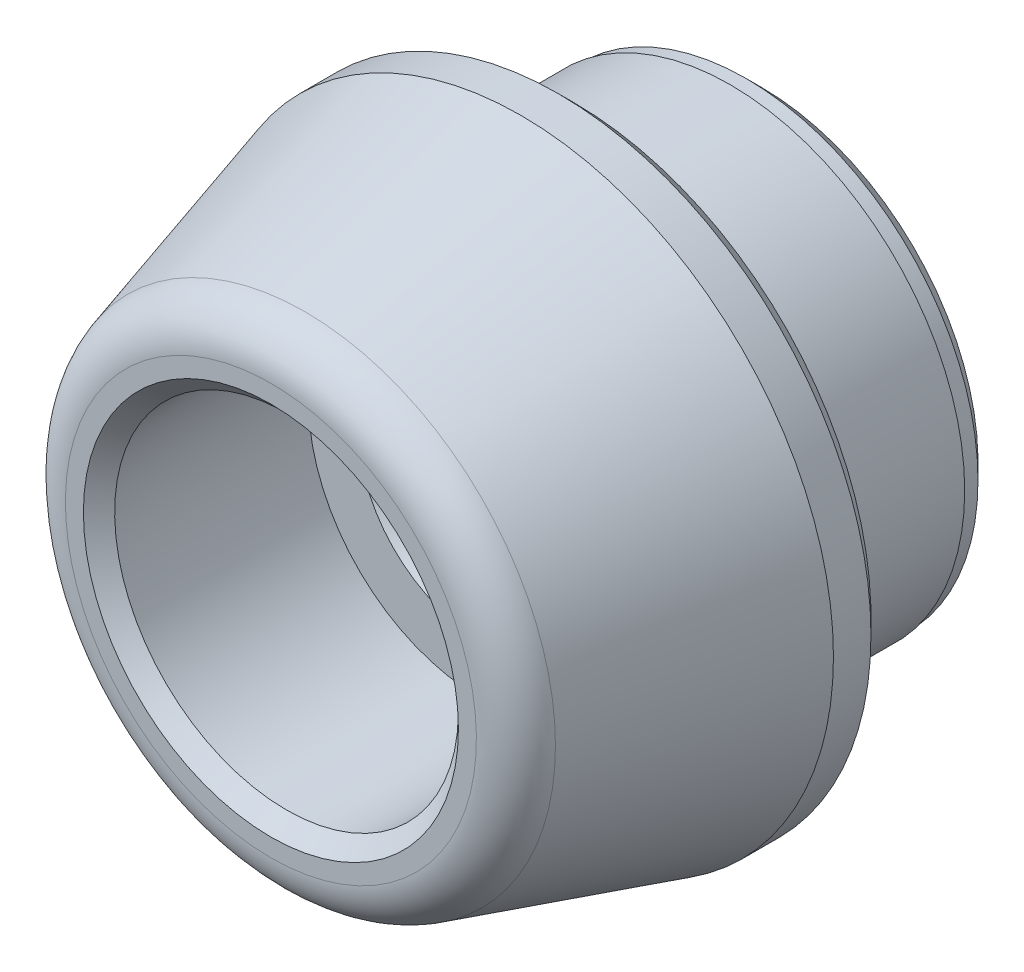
ISO-10303-21;
HEADER;
FILE_DESCRIPTION(('STEP AP214'),'2;1');
FILE_NAME('part.step','',(''),(''),'','','');
FILE_SCHEMA(('AUTOMOTIVE_DESIGN { 1 0 10303 214 1 1 1 1 }'));
ENDSEC;
DATA;
#1=APPLICATION_CONTEXT('core data for automotive mechanical design processes');
#2=APPLICATION_PROTOCOL_DEFINITION('international standard','automotive_design',2000,#1);
#3=PRODUCT_CONTEXT('',#1,'mechanical');
#4=PRODUCT('Part','Part','',(#3));
#5=PRODUCT_RELATED_PRODUCT_CATEGORY('part','',(#4));
#6=PRODUCT_DEFINITION_FORMATION('','',#4);
#7=PRODUCT_DEFINITION_CONTEXT('part definition',#1,'design');
#8=PRODUCT_DEFINITION('design','',#6,#7);
#9=PRODUCT_DEFINITION_SHAPE('','',#8);
#10=(LENGTH_UNIT() NAMED_UNIT(*) SI_UNIT(.MILLI.,.METRE.));
#11=(NAMED_UNIT(*) PLANE_ANGLE_UNIT() SI_UNIT($,.RADIAN.));
#12=(NAMED_UNIT(*) SI_UNIT($,.STERADIAN.) SOLID_ANGLE_UNIT());
#13=UNCERTAINTY_MEASURE_WITH_UNIT(LENGTH_MEASURE(1.E-05),#10,'distance_accuracy_value','');
#14=(GEOMETRIC_REPRESENTATION_CONTEXT(3) GLOBAL_UNCERTAINTY_ASSIGNED_CONTEXT((#13)) GLOBAL_UNIT_ASSIGNED_CONTEXT((#10,
#11,#12)) REPRESENTATION_CONTEXT('',''));
#15=CARTESIAN_POINT('',(0.,0.,0.));
#16=DIRECTION('',(0.,0.,1.));
#17=DIRECTION('',(1.,0.,0.));
#18=AXIS2_PLACEMENT_3D('',#15,#16,#17);
#19=CARTESIAN_POINT('',(0.,0.,0.));
#20=DIRECTION('',(0.,0.,-1.));
#21=DIRECTION('',(0.,1.,0.));
#22=AXIS2_PLACEMENT_3D('',#19,#20,#21);
#23=CYLINDRICAL_SURFACE('',#22,7.5);
#24=CARTESIAN_POINT('',(0.,0.,4.8));
#25=DIRECTION('',(0.,0.,-1.));
#26=DIRECTION('',(0.,1.,0.));
#27=AXIS2_PLACEMENT_3D('',#24,#25,#26);
#28=CIRCLE('',#27,7.5);
#29=CARTESIAN_POINT('',(0.,7.49999999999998,4.80000000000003));
#30=VERTEX_POINT('',#29);
#31=EDGE_CURVE('E76',#30,#30,#28,.T.);
#32=ORIENTED_EDGE('',*,*,#31,.T.);
#33=EDGE_LOOP('',(#32));
#34=FACE_BOUND('',#33,.T.);
#35=CARTESIAN_POINT('',(0.,0.,1.));
#36=DIRECTION('',(0.,0.,-1.));
#37=DIRECTION('',(0.,1.,0.));
#38=AXIS2_PLACEMENT_3D('',#35,#36,#37);
#39=CIRCLE('',#38,7.5);
#40=CARTESIAN_POINT('',(0.,7.5,1.00000000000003));
#41=VERTEX_POINT('',#40);
#42=EDGE_CURVE('E79',#41,#41,#39,.T.);
#43=ORIENTED_EDGE('',*,*,#42,.F.);
#44=EDGE_LOOP('',(#43));
#45=FACE_BOUND('',#44,.T.);
#46=ADVANCED_FACE('F14',(#34,#45),#23,.T.);
#47=CARTESIAN_POINT('',(0.,0.,0.));
#48=DIRECTION('',(0.,0.,-1.));
#49=DIRECTION('',(0.,1.,0.));
#50=AXIS2_PLACEMENT_3D('',#47,#48,#49);
#51=PLANE('',#50);
#52=CARTESIAN_POINT('',(0.,0.,0.));
#53=DIRECTION('',(0.,0.,-1.));
#54=DIRECTION('',(0.,1.,0.));
#55=AXIS2_PLACEMENT_3D('',#52,#53,#54);
#56=CIRCLE('',#55,6.925);
#57=CARTESIAN_POINT('',(0.,6.925,0.));
#58=VERTEX_POINT('',#57);
#59=EDGE_CURVE('E21',#58,#58,#56,.T.);
#60=ORIENTED_EDGE('',*,*,#59,.T.);
#61=EDGE_LOOP('',(#60));
#62=FACE_BOUND('',#61,.T.);
#63=CARTESIAN_POINT('',(0.,0.,0.));
#64=DIRECTION('',(0.,0.,-1.));
#65=DIRECTION('',(0.,1.,0.));
#66=AXIS2_PLACEMENT_3D('',#63,#64,#65);
#67=CIRCLE('',#66,4.4);
#68=CARTESIAN_POINT('',(0.,4.4,0.));
#69=VERTEX_POINT('',#68);
#70=EDGE_CURVE('E29',#69,#69,#67,.F.);
#71=ORIENTED_EDGE('',*,*,#70,.T.);
#72=EDGE_LOOP('',(#71));
#73=FACE_BOUND('',#72,.T.);
#74=ADVANCED_FACE('F105',(#62,#73),#51,.T.);
#75=CARTESIAN_POINT('',(0.,0.,15.7));
#76=DIRECTION('',(0.,0.,1.));
#77=DIRECTION('',(0.,-1.,0.));
#78=AXIS2_PLACEMENT_3D('',#75,#76,#77);
#79=CYLINDRICAL_SURFACE('',#78,3.4);
#80=CARTESIAN_POINT('',(0.,0.,1.));
#81=DIRECTION('',(0.,0.,-1.));
#82=DIRECTION('',(0.,1.,0.));
#83=AXIS2_PLACEMENT_3D('',#80,#81,#82);
#84=CIRCLE('',#83,3.4);
#85=CARTESIAN_POINT('',(0.,3.4,1.00000000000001));
#86=VERTEX_POINT('',#85);
#87=EDGE_CURVE('E25',#86,#86,#84,.T.);
#88=ORIENTED_EDGE('',*,*,#87,.T.);
#89=EDGE_LOOP('',(#88));
#90=FACE_BOUND('',#89,.T.);
#91=CARTESIAN_POINT('',(0.,0.,8.5));
#92=DIRECTION('',(0.,0.,1.));
#93=DIRECTION('',(0.,-1.,0.));
#94=AXIS2_PLACEMENT_3D('',#91,#92,#93);
#95=CIRCLE('',#94,3.4);
#96=CARTESIAN_POINT('',(0.,-3.40000000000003,8.49999999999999));
#97=VERTEX_POINT('',#96);
#98=EDGE_CURVE('E40',#97,#97,#95,.T.);
#99=ORIENTED_EDGE('',*,*,#98,.T.);
#100=EDGE_LOOP('',(#99));
#101=FACE_BOUND('',#100,.T.);
#102=ADVANCED_FACE('F112',(#90,#101),#79,.F.);
#103=CARTESIAN_POINT('',(0.,0.,15.7));
#104=DIRECTION('',(0.,0.,1.));
#105=DIRECTION('',(0.,-1.,0.));
#106=AXIS2_PLACEMENT_3D('',#103,#104,#105);
#107=PLANE('',#106);
#108=CARTESIAN_POINT('',(0.,0.,15.7));
#109=DIRECTION('',(0.,0.,1.));
#110=DIRECTION('',(0.,-1.,0.));
#111=AXIS2_PLACEMENT_3D('',#108,#109,#110);
#112=CIRCLE('',#111,6.);
#113=CARTESIAN_POINT('',(0.,-6.00000000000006,15.7));
#114=VERTEX_POINT('',#113);
#115=EDGE_CURVE('E34',#114,#114,#112,.F.);
#116=ORIENTED_EDGE('',*,*,#115,.T.);
#117=EDGE_LOOP('',(#116));
#118=FACE_BOUND('',#117,.T.);
#119=CARTESIAN_POINT('',(0.,0.,15.7));
#120=DIRECTION('',(0.,0.,1.));
#121=DIRECTION('',(0.,-1.,0.));
#122=AXIS2_PLACEMENT_3D('',#119,#120,#121);
#123=CIRCLE('',#122,6.57570583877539);
#124=CARTESIAN_POINT('',(0.,-6.57570583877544,15.7));
#125=VERTEX_POINT('',#124);
#126=EDGE_CURVE('E52',#125,#125,#123,.T.);
#127=ORIENTED_EDGE('',*,*,#126,.T.);
#128=EDGE_LOOP('',(#127));
#129=FACE_BOUND('',#128,.T.);
#130=ADVANCED_FACE('F129',(#118,#129),#107,.T.);
#131=CARTESIAN_POINT('',(0.,0.,7.7));
#132=DIRECTION('',(0.,0.,-1.));
#133=DIRECTION('',(0.,1.,0.));
#134=AXIS2_PLACEMENT_3D('',#131,#132,#133);
#135=CONICAL_SURFACE('',#134,10.,0.279252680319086);
#136=CARTESIAN_POINT('',(0.,0.,14.6134560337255));
#137=DIRECTION('',(0.,0.,1.));
#138=DIRECTION('',(0.,-1.,0.));
#139=AXIS2_PLACEMENT_3D('',#136,#137,#138);
#140=CIRCLE('',#139,8.01759838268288);
#141=CARTESIAN_POINT('',(0.,-8.01759838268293,14.6134560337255));
#142=VERTEX_POINT('',#141);
#143=EDGE_CURVE('E55',#142,#142,#140,.F.);
#144=ORIENTED_EDGE('',*,*,#143,.T.);
#145=EDGE_LOOP('',(#144));
#146=FACE_BOUND('',#145,.T.);
#147=CARTESIAN_POINT('',(0.,0.,7.7));
#148=DIRECTION('',(0.,0.,-1.));
#149=DIRECTION('',(0.,1.,0.));
#150=AXIS2_PLACEMENT_3D('',#147,#148,#149);
#151=CIRCLE('',#150,10.);
#152=CARTESIAN_POINT('',(0.,9.99999999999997,7.70000000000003));
#153=VERTEX_POINT('',#152);
#154=EDGE_CURVE('E58',#153,#153,#151,.T.);
#155=ORIENTED_EDGE('',*,*,#154,.F.);
#156=EDGE_LOOP('',(#155));
#157=FACE_BOUND('',#156,.T.);
#158=ADVANCED_FACE('F125',(#146,#157),#135,.T.);
#159=CARTESIAN_POINT('',(0.,0.,0.));
#160=DIRECTION('',(0.,0.,-1.));
#161=DIRECTION('',(0.,1.,0.));
#162=AXIS2_PLACEMENT_3D('',#159,#160,#161);
#163=CYLINDRICAL_SURFACE('',#162,10.);
#164=CARTESIAN_POINT('',(0.,0.,6.5));
#165=DIRECTION('',(0.,0.,-1.));
#166=DIRECTION('',(0.,1.,0.));
#167=AXIS2_PLACEMENT_3D('',#164,#165,#166);
#168=CIRCLE('',#167,10.);
#169=CARTESIAN_POINT('',(0.,9.99999999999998,6.50000000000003));
#170=VERTEX_POINT('',#169);
#171=EDGE_CURVE('E46',#170,#170,#168,.F.);
#172=ORIENTED_EDGE('',*,*,#171,.T.);
#173=EDGE_LOOP('',(#172));
#174=FACE_BOUND('',#173,.T.);
#175=ORIENTED_EDGE('',*,*,#154,.T.);
#176=EDGE_LOOP('',(#175));
#177=FACE_BOUND('',#176,.T.);
#178=ADVANCED_FACE('F121',(#174,#177),#163,.T.);
#179=CARTESIAN_POINT('',(10.,0.,6.));
#180=DIRECTION('',(0.,0.,-1.));
#181=DIRECTION('',(0.,1.,0.));
#182=AXIS2_PLACEMENT_3D('',#179,#180,#181);
#183=PLANE('',#182);
#184=CARTESIAN_POINT('',(0.,0.,6.));
#185=DIRECTION('',(0.,0.,-1.));
#186=DIRECTION('',(0.,1.,0.));
#187=AXIS2_PLACEMENT_3D('',#184,#185,#186);
#188=CIRCLE('',#187,9.5);
#189=CARTESIAN_POINT('',(0.,9.49999999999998,6.00000000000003));
#190=VERTEX_POINT('',#189);
#191=EDGE_CURVE('E49',#190,#190,#188,.T.);
#192=ORIENTED_EDGE('',*,*,#191,.T.);
#193=EDGE_LOOP('',(#192));
#194=FACE_BOUND('',#193,.T.);
#195=CARTESIAN_POINT('',(0.,0.,6.));
#196=DIRECTION('',(0.,0.,-1.));
#197=DIRECTION('',(0.,1.,0.));
#198=AXIS2_PLACEMENT_3D('',#195,#196,#197);
#199=CIRCLE('',#198,8.3);
#200=CARTESIAN_POINT('',(0.,8.29999999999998,6.00000000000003));
#201=VERTEX_POINT('',#200);
#202=EDGE_CURVE('E73',#201,#201,#199,.T.);
#203=ORIENTED_EDGE('',*,*,#202,.F.);
#204=EDGE_LOOP('',(#203));
#205=FACE_BOUND('',#204,.T.);
#206=ADVANCED_FACE('F117',(#194,#205),#183,.T.);
#207=CARTESIAN_POINT('',(0.,0.,9.));
#208=DIRECTION('',(0.,0.,1.));
#209=DIRECTION('',(0.,-1.,0.));
#210=AXIS2_PLACEMENT_3D('',#207,#208,#209);
#211=PLANE('',#210);
#212=CARTESIAN_POINT('',(0.,0.,9.));
#213=DIRECTION('',(0.,0.,1.));
#214=DIRECTION('',(0.,-1.,0.));
#215=AXIS2_PLACEMENT_3D('',#212,#213,#214);
#216=CIRCLE('',#215,3.9);
#217=CARTESIAN_POINT('',(0.,-3.90000000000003,8.99999999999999));
#218=VERTEX_POINT('',#217);
#219=EDGE_CURVE('E43',#218,#218,#216,.F.);
#220=ORIENTED_EDGE('',*,*,#219,.T.);
#221=EDGE_LOOP('',(#220));
#222=FACE_BOUND('',#221,.T.);
#223=CARTESIAN_POINT('',(0.,0.,9.));
#224=DIRECTION('',(0.,0.,1.));
#225=DIRECTION('',(0.,-1.,0.));
#226=AXIS2_PLACEMENT_3D('',#223,#224,#225);
#227=CIRCLE('',#226,5.5);
#228=CARTESIAN_POINT('',(0.,-5.50000000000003,8.99999999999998));
#229=VERTEX_POINT('',#228);
#230=EDGE_CURVE('E61',#229,#229,#227,.T.);
#231=ORIENTED_EDGE('',*,*,#230,.T.);
#232=EDGE_LOOP('',(#231));
#233=FACE_BOUND('',#232,.T.);
#234=ADVANCED_FACE('F120',(#222,#233),#211,.T.);
#235=CARTESIAN_POINT('',(0.,0.,9.));
#236=DIRECTION('',(0.,0.,1.));
#237=DIRECTION('',(0.,-1.,0.));
#238=AXIS2_PLACEMENT_3D('',#235,#236,#237);
#239=CYLINDRICAL_SURFACE('',#238,5.5);
#240=CARTESIAN_POINT('',(0.,0.,15.2));
#241=DIRECTION('',(0.,0.,1.));
#242=DIRECTION('',(0.,-1.,0.));
#243=AXIS2_PLACEMENT_3D('',#240,#241,#242);
#244=CIRCLE('',#243,5.5);
#245=CARTESIAN_POINT('',(0.,-5.50000000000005,15.2));
#246=VERTEX_POINT('',#245);
#247=EDGE_CURVE('E37',#246,#246,#244,.T.);
#248=ORIENTED_EDGE('',*,*,#247,.T.);
#249=EDGE_LOOP('',(#248));
#250=FACE_BOUND('',#249,.T.);
#251=ORIENTED_EDGE('',*,*,#230,.F.);
#252=EDGE_LOOP('',(#251));
#253=FACE_BOUND('',#252,.T.);
#254=ADVANCED_FACE('F138',(#250,#253),#239,.F.);
#255=CARTESIAN_POINT('',(0.,0.,14.2));
#256=DIRECTION('',(0.,0.,1.));
#257=DIRECTION('',(0.,-1.,0.));
#258=AXIS2_PLACEMENT_3D('',#255,#256,#257);
#259=TOROIDAL_SURFACE('',#258,6.57570583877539,1.5);
#260=ORIENTED_EDGE('',*,*,#126,.F.);
#261=EDGE_LOOP('',(#260));
#262=FACE_BOUND('',#261,.T.);
#263=ORIENTED_EDGE('',*,*,#143,.F.);
#264=EDGE_LOOP('',(#263));
#265=FACE_BOUND('',#264,.T.);
#266=ADVANCED_FACE('F134',(#262,#265),#259,.T.);
#267=CARTESIAN_POINT('',(0.,0.,5.66602540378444));
#268=DIRECTION('',(0.,0.,-1.));
#269=DIRECTION('',(0.,1.,0.));
#270=AXIS2_PLACEMENT_3D('',#267,#268,#269);
#271=CONICAL_SURFACE('',#270,7.,0.523598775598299);
#272=ORIENTED_EDGE('',*,*,#31,.F.);
#273=EDGE_LOOP('',(#272));
#274=FACE_BOUND('',#273,.T.);
#275=CARTESIAN_POINT('',(0.,0.,5.66602540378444));
#276=DIRECTION('',(0.,0.,-1.));
#277=DIRECTION('',(0.,1.,0.));
#278=AXIS2_PLACEMENT_3D('',#275,#276,#277);
#279=CIRCLE('',#278,7.);
#280=CARTESIAN_POINT('',(0.,6.99999999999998,5.66602540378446));
#281=VERTEX_POINT('',#280);
#282=EDGE_CURVE('E64',#281,#281,#279,.T.);
#283=ORIENTED_EDGE('',*,*,#282,.T.);
#284=EDGE_LOOP('',(#283));
#285=FACE_BOUND('',#284,.T.);
#286=ADVANCED_FACE('F137',(#274,#285),#271,.T.);
#287=CARTESIAN_POINT('',(0.,0.,0.));
#288=DIRECTION('',(0.,0.,-1.));
#289=DIRECTION('',(0.,1.,0.));
#290=AXIS2_PLACEMENT_3D('',#287,#288,#289);
#291=CYLINDRICAL_SURFACE('',#290,7.);
#292=ORIENTED_EDGE('',*,*,#282,.F.);
#293=EDGE_LOOP('',(#292));
#294=FACE_BOUND('',#293,.T.);
#295=CARTESIAN_POINT('',(0.,0.,6.1));
#296=DIRECTION('',(0.,0.,-1.));
#297=DIRECTION('',(0.,1.,0.));
#298=AXIS2_PLACEMENT_3D('',#295,#296,#297);
#299=CIRCLE('',#298,7.);
#300=CARTESIAN_POINT('',(0.,6.99999999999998,6.10000000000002));
#301=VERTEX_POINT('',#300);
#302=EDGE_CURVE('E67',#301,#301,#299,.T.);
#303=ORIENTED_EDGE('',*,*,#302,.T.);
#304=EDGE_LOOP('',(#303));
#305=FACE_BOUND('',#304,.T.);
#306=ADVANCED_FACE('F183',(#294,#305),#291,.T.);
#307=CARTESIAN_POINT('',(0.,0.,6.1));
#308=DIRECTION('',(0.,0.,-1.));
#309=DIRECTION('',(0.,1.,0.));
#310=AXIS2_PLACEMENT_3D('',#307,#308,#309);
#311=TOROIDAL_SURFACE('',#310,7.4,0.4);
#312=ORIENTED_EDGE('',*,*,#302,.F.);
#313=EDGE_LOOP('',(#312));
#314=FACE_BOUND('',#313,.T.);
#315=CARTESIAN_POINT('',(0.,0.,6.43715290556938));
#316=DIRECTION('',(0.,0.,-1.));
#317=DIRECTION('',(0.,1.,0.));
#318=AXIS2_PLACEMENT_3D('',#315,#316,#317);
#319=CIRCLE('',#318,7.61523921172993);
#320=CARTESIAN_POINT('',(0.,7.61523921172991,6.43715290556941));
#321=VERTEX_POINT('',#320);
#322=EDGE_CURVE('E70',#321,#321,#319,.T.);
#323=ORIENTED_EDGE('',*,*,#322,.T.);
#324=EDGE_LOOP('',(#323));
#325=FACE_BOUND('',#324,.T.);
#326=ADVANCED_FACE('F101',(#314,#325),#311,.F.);
#327=CARTESIAN_POINT('',(0.,0.,6.));
#328=DIRECTION('',(0.,0.,-1.));
#329=DIRECTION('',(0.,1.,0.));
#330=AXIS2_PLACEMENT_3D('',#327,#328,#329);
#331=CONICAL_SURFACE('',#330,8.3,1.00261735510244);
#332=ORIENTED_EDGE('',*,*,#322,.F.);
#333=EDGE_LOOP('',(#332));
#334=FACE_BOUND('',#333,.T.);
#335=ORIENTED_EDGE('',*,*,#202,.T.);
#336=EDGE_LOOP('',(#335));
#337=FACE_BOUND('',#336,.T.);
#338=ADVANCED_FACE('F90',(#334,#337),#331,.F.);
#339=CARTESIAN_POINT('',(-7.5,0.,1.));
#340=DIRECTION('',(0.,0.,-1.));
#341=DIRECTION('',(0.,1.,0.));
#342=AXIS2_PLACEMENT_3D('',#339,#340,#341);
#343=PLANE('',#342);
#344=ORIENTED_EDGE('',*,*,#42,.T.);
#345=EDGE_LOOP('',(#344));
#346=FACE_BOUND('',#345,.T.);
#347=CARTESIAN_POINT('',(0.,0.,1.));
#348=DIRECTION('',(0.,0.,-1.));
#349=DIRECTION('',(0.,1.,0.));
#350=AXIS2_PLACEMENT_3D('',#347,#348,#349);
#351=CIRCLE('',#350,7.425);
#352=CARTESIAN_POINT('',(0.,7.425,1.00000000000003));
#353=VERTEX_POINT('',#352);
#354=EDGE_CURVE('E82',#353,#353,#351,.T.);
#355=ORIENTED_EDGE('',*,*,#354,.F.);
#356=EDGE_LOOP('',(#355));
#357=FACE_BOUND('',#356,.T.);
#358=ADVANCED_FACE('F88',(#346,#357),#343,.T.);
#359=CARTESIAN_POINT('',(0.,0.,0.));
#360=DIRECTION('',(0.,0.,-1.));
#361=DIRECTION('',(0.,1.,0.));
#362=AXIS2_PLACEMENT_3D('',#359,#360,#361);
#363=CYLINDRICAL_SURFACE('',#362,7.425);
#364=CARTESIAN_POINT('',(0.,0.,0.5));
#365=DIRECTION('',(0.,0.,-1.));
#366=DIRECTION('',(0.,1.,0.));
#367=AXIS2_PLACEMENT_3D('',#364,#365,#366);
#368=CIRCLE('',#367,7.425);
#369=CARTESIAN_POINT('',(0.,7.425,0.500000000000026));
#370=VERTEX_POINT('',#369);
#371=EDGE_CURVE('E9',#370,#370,#368,.F.);
#372=ORIENTED_EDGE('',*,*,#371,.T.);
#373=EDGE_LOOP('',(#372));
#374=FACE_BOUND('',#373,.T.);
#375=ORIENTED_EDGE('',*,*,#354,.T.);
#376=EDGE_LOOP('',(#375));
#377=FACE_BOUND('',#376,.T.);
#378=ADVANCED_FACE('F86',(#374,#377),#363,.T.);
#379=CARTESIAN_POINT('',(0.,0.,6.));
#380=DIRECTION('',(0.,0.,1.));
#381=DIRECTION('',(0.,-1.,0.));
#382=AXIS2_PLACEMENT_3D('',#379,#380,#381);
#383=CONICAL_SURFACE('',#382,9.5,0.785398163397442);
#384=ORIENTED_EDGE('',*,*,#171,.F.);
#385=EDGE_LOOP('',(#384));
#386=FACE_BOUND('',#385,.T.);
#387=ORIENTED_EDGE('',*,*,#191,.F.);
#388=EDGE_LOOP('',(#387));
#389=FACE_BOUND('',#388,.T.);
#390=ADVANCED_FACE('F99',(#386,#389),#383,.T.);
#391=CARTESIAN_POINT('',(0.,0.,9.));
#392=DIRECTION('',(0.,0.,1.));
#393=DIRECTION('',(0.,-1.,0.));
#394=AXIS2_PLACEMENT_3D('',#391,#392,#393);
#395=CONICAL_SURFACE('',#394,3.9,0.785398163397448);
#396=ORIENTED_EDGE('',*,*,#98,.F.);
#397=EDGE_LOOP('',(#396));
#398=FACE_BOUND('',#397,.T.);
#399=ORIENTED_EDGE('',*,*,#219,.F.);
#400=EDGE_LOOP('',(#399));
#401=FACE_BOUND('',#400,.T.);
#402=ADVANCED_FACE('F142',(#398,#401),#395,.F.);
#403=CARTESIAN_POINT('',(0.,0.,15.2));
#404=DIRECTION('',(0.,0.,1.));
#405=DIRECTION('',(0.,-1.,0.));
#406=AXIS2_PLACEMENT_3D('',#403,#404,#405);
#407=CONICAL_SURFACE('',#406,5.5,0.785398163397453);
#408=ORIENTED_EDGE('',*,*,#115,.F.);
#409=EDGE_LOOP('',(#408));
#410=FACE_BOUND('',#409,.T.);
#411=ORIENTED_EDGE('',*,*,#247,.F.);
#412=EDGE_LOOP('',(#411));
#413=FACE_BOUND('',#412,.T.);
#414=ADVANCED_FACE('F146',(#410,#413),#407,.F.);
#415=CARTESIAN_POINT('',(0.,0.,0.));
#416=DIRECTION('',(0.,0.,-1.));
#417=DIRECTION('',(0.,1.,0.));
#418=AXIS2_PLACEMENT_3D('',#415,#416,#417);
#419=CONICAL_SURFACE('',#418,4.4,0.78539816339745);
#420=ORIENTED_EDGE('',*,*,#87,.F.);
#421=EDGE_LOOP('',(#420));
#422=FACE_BOUND('',#421,.T.);
#423=ORIENTED_EDGE('',*,*,#70,.F.);
#424=EDGE_LOOP('',(#423));
#425=FACE_BOUND('',#424,.T.);
#426=ADVANCED_FACE('F149',(#422,#425),#419,.F.);
#427=CARTESIAN_POINT('',(0.,0.,0.));
#428=DIRECTION('',(0.,0.,1.));
#429=DIRECTION('',(0.,-1.,0.));
#430=AXIS2_PLACEMENT_3D('',#427,#428,#429);
#431=CONICAL_SURFACE('',#430,6.925,0.785398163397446);
#432=ORIENTED_EDGE('',*,*,#371,.F.);
#433=EDGE_LOOP('',(#432));
#434=FACE_BOUND('',#433,.T.);
#435=ORIENTED_EDGE('',*,*,#59,.F.);
#436=EDGE_LOOP('',(#435));
#437=FACE_BOUND('',#436,.T.);
#438=ADVANCED_FACE('F16',(#434,#437),#431,.T.);
#439=CLOSED_SHELL('',(#46,#74,#102,#130,#158,#178,#206,#234,#254,#266,#286,#306,#326,#338,#358,
#378,#390,#402,#414,#426,#438));
#440=MANIFOLD_SOLID_BREP('B1',#439);
#441=ADVANCED_BREP_SHAPE_REPRESENTATION('',(#18,#440),#14);
#442=SHAPE_DEFINITION_REPRESENTATION(#9,#441);
ENDSEC;
END-ISO-10303-21;
